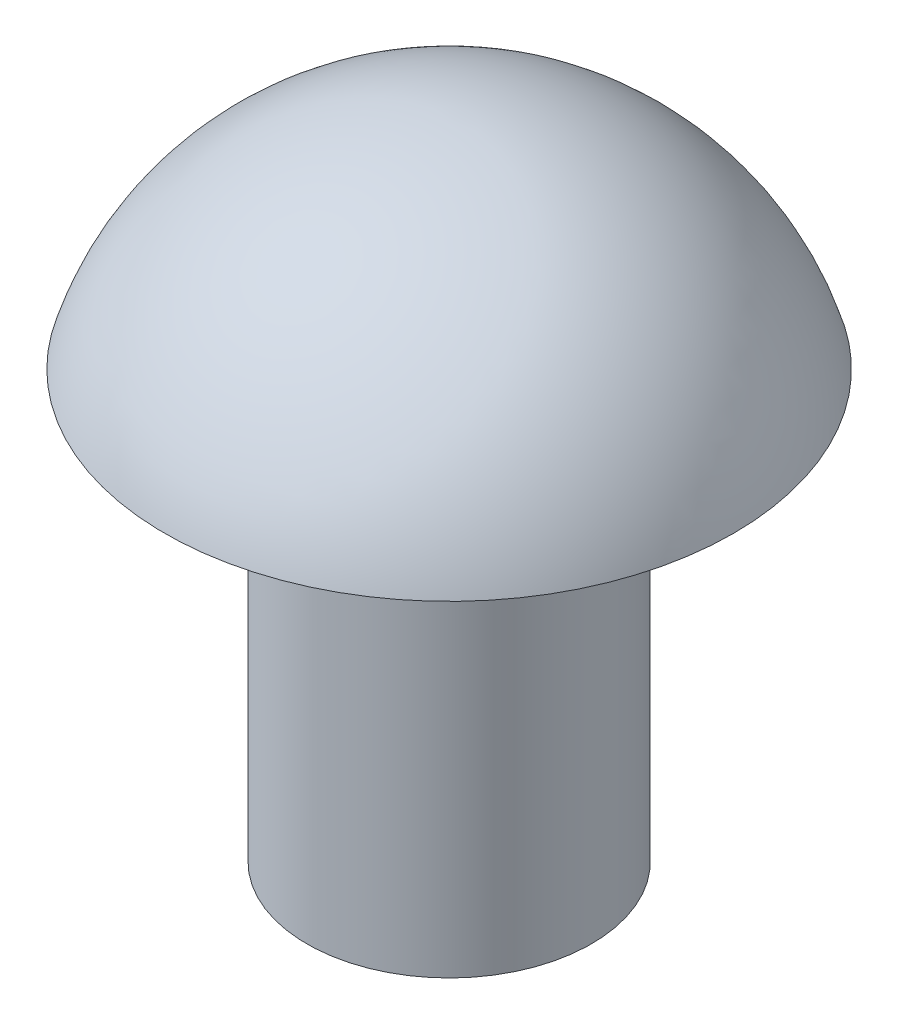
ISO-10303-21;
HEADER;
FILE_DESCRIPTION(('STEP AP214'),'2;1');
FILE_NAME('part.step','',(''),(''),'','','');
FILE_SCHEMA(('AUTOMOTIVE_DESIGN { 1 0 10303 214 1 1 1 1 }'));
ENDSEC;
DATA;
#1=APPLICATION_CONTEXT('core data for automotive mechanical design processes');
#2=APPLICATION_PROTOCOL_DEFINITION('international standard','automotive_design',2000,#1);
#3=PRODUCT_CONTEXT('',#1,'mechanical');
#4=PRODUCT('Part','Part','',(#3));
#5=PRODUCT_RELATED_PRODUCT_CATEGORY('part','',(#4));
#6=PRODUCT_DEFINITION_FORMATION('','',#4);
#7=PRODUCT_DEFINITION_CONTEXT('part definition',#1,'design');
#8=PRODUCT_DEFINITION('design','',#6,#7);
#9=PRODUCT_DEFINITION_SHAPE('','',#8);
#10=(LENGTH_UNIT() NAMED_UNIT(*) SI_UNIT(.MILLI.,.METRE.));
#11=(NAMED_UNIT(*) PLANE_ANGLE_UNIT() SI_UNIT($,.RADIAN.));
#12=(NAMED_UNIT(*) SI_UNIT($,.STERADIAN.) SOLID_ANGLE_UNIT());
#13=UNCERTAINTY_MEASURE_WITH_UNIT(LENGTH_MEASURE(1.E-05),#10,'distance_accuracy_value','');
#14=(GEOMETRIC_REPRESENTATION_CONTEXT(3) GLOBAL_UNCERTAINTY_ASSIGNED_CONTEXT((#13)) GLOBAL_UNIT_ASSIGNED_CONTEXT((#10,
#11,#12)) REPRESENTATION_CONTEXT('',''));
#15=CARTESIAN_POINT('',(0.,0.,0.));
#16=DIRECTION('',(0.,0.,1.));
#17=DIRECTION('',(1.,0.,0.));
#18=AXIS2_PLACEMENT_3D('',#15,#16,#17);
#19=CARTESIAN_POINT('',(0.,0.,0.));
#20=DIRECTION('',(0.,-1.,0.));
#21=DIRECTION('',(0.,0.,-1.));
#22=AXIS2_PLACEMENT_3D('',#19,#20,#21);
#23=PLANE('',#22);
#24=CARTESIAN_POINT('',(0.,0.,0.));
#25=DIRECTION('',(0.,-1.,0.));
#26=DIRECTION('',(0.,0.,-1.));
#27=AXIS2_PLACEMENT_3D('',#24,#25,#26);
#28=CIRCLE('',#27,1.);
#29=CARTESIAN_POINT('',(0.,0.,-1.));
#30=VERTEX_POINT('',#29);
#31=EDGE_CURVE('E10',#30,#30,#28,.T.);
#32=ORIENTED_EDGE('',*,*,#31,.T.);
#33=EDGE_LOOP('',(#32));
#34=FACE_BOUND('',#33,.T.);
#35=ADVANCED_FACE('F30',(#34),#23,.T.);
#36=CARTESIAN_POINT('',(0.,0.,0.));
#37=DIRECTION('',(0.,-1.,0.));
#38=DIRECTION('',(0.,0.,-1.));
#39=AXIS2_PLACEMENT_3D('',#36,#37,#38);
#40=CYLINDRICAL_SURFACE('',#39,1.);
#41=CARTESIAN_POINT('',(0.,3.,0.));
#42=DIRECTION('',(0.,-1.,0.));
#43=DIRECTION('',(0.,0.,-1.));
#44=AXIS2_PLACEMENT_3D('',#41,#42,#43);
#45=CIRCLE('',#44,1.);
#46=CARTESIAN_POINT('',(0.,3.,-1.));
#47=VERTEX_POINT('',#46);
#48=EDGE_CURVE('E36',#47,#47,#45,.T.);
#49=ORIENTED_EDGE('',*,*,#48,.T.);
#50=EDGE_LOOP('',(#49));
#51=FACE_BOUND('',#50,.T.);
#52=ORIENTED_EDGE('',*,*,#31,.F.);
#53=EDGE_LOOP('',(#52));
#54=FACE_BOUND('',#53,.T.);
#55=ADVANCED_FACE('F56',(#51,#54),#40,.T.);
#56=CARTESIAN_POINT('',(2.,3.,0.));
#57=DIRECTION('',(0.,-1.,0.));
#58=DIRECTION('',(0.,0.,-1.));
#59=AXIS2_PLACEMENT_3D('',#56,#57,#58);
#60=PLANE('',#59);
#61=CARTESIAN_POINT('',(0.,3.,0.));
#62=DIRECTION('',(0.,-1.,0.));
#63=DIRECTION('',(0.,0.,-1.));
#64=AXIS2_PLACEMENT_3D('',#61,#62,#63);
#65=CIRCLE('',#64,2.);
#66=CARTESIAN_POINT('',(0.,3.,-2.));
#67=VERTEX_POINT('',#66);
#68=EDGE_CURVE('E40',#67,#67,#65,.T.);
#69=ORIENTED_EDGE('',*,*,#68,.T.);
#70=EDGE_LOOP('',(#69));
#71=FACE_BOUND('',#70,.T.);
#72=ORIENTED_EDGE('',*,*,#48,.F.);
#73=EDGE_LOOP('',(#72));
#74=FACE_BOUND('',#73,.T.);
#75=ADVANCED_FACE('F47',(#71,#74),#60,.T.);
#76=CARTESIAN_POINT('',(0.,2.41666666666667,0.));
#77=DIRECTION('',(0.,-1.,0.));
#78=DIRECTION('',(1.,0.,0.));
#79=AXIS2_PLACEMENT_3D('',#76,#77,#78);
#80=SPHERICAL_SURFACE('',#79,2.08333333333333);
#81=ORIENTED_EDGE('',*,*,#68,.F.);
#82=EDGE_LOOP('',(#81));
#83=FACE_BOUND('',#82,.T.);
#84=ADVANCED_FACE('F50',(#83),#80,.T.);
#85=CLOSED_SHELL('',(#35,#55,#75,#84));
#86=MANIFOLD_SOLID_BREP('B2',#85);
#87=ADVANCED_BREP_SHAPE_REPRESENTATION('',(#18,#86),#14);
#88=SHAPE_DEFINITION_REPRESENTATION(#9,#87);
ENDSEC;
END-ISO-10303-21;
